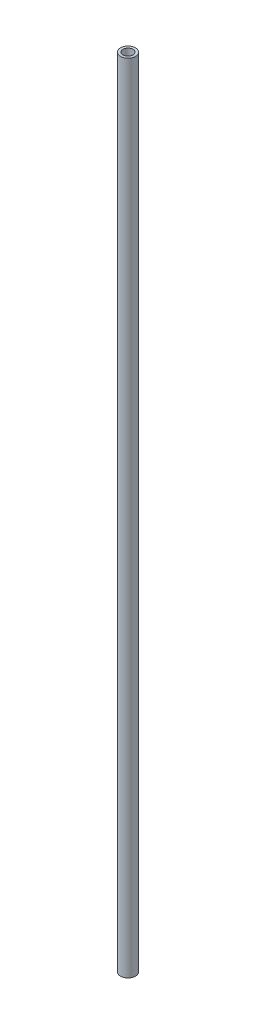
from build123d import *

# Parameters (mm, degrees)
SKETCH_1_R      = 1.5
SKETCH_1_R_2    = 1
EXTRUDE_1_DEPTH = 160


with BuildPart() as part:
    # Sketch 1 → Extrude 1 (new body)
    with BuildSketch(Plane(origin=(0, 0, 0), x_dir=(1, 0, 0), z_dir=(0, 1, 0))):
        with Locations(Location((0, 0, 0), (0, 0, 270))):
            Circle(SKETCH_1_R)
        with Locations(Location((0, 0, 0), (0, 0, 270))):
            Circle(SKETCH_1_R_2, mode=Mode.SUBTRACT)
    extrude(amount=EXTRUDE_1_DEPTH)


solid = part.part
